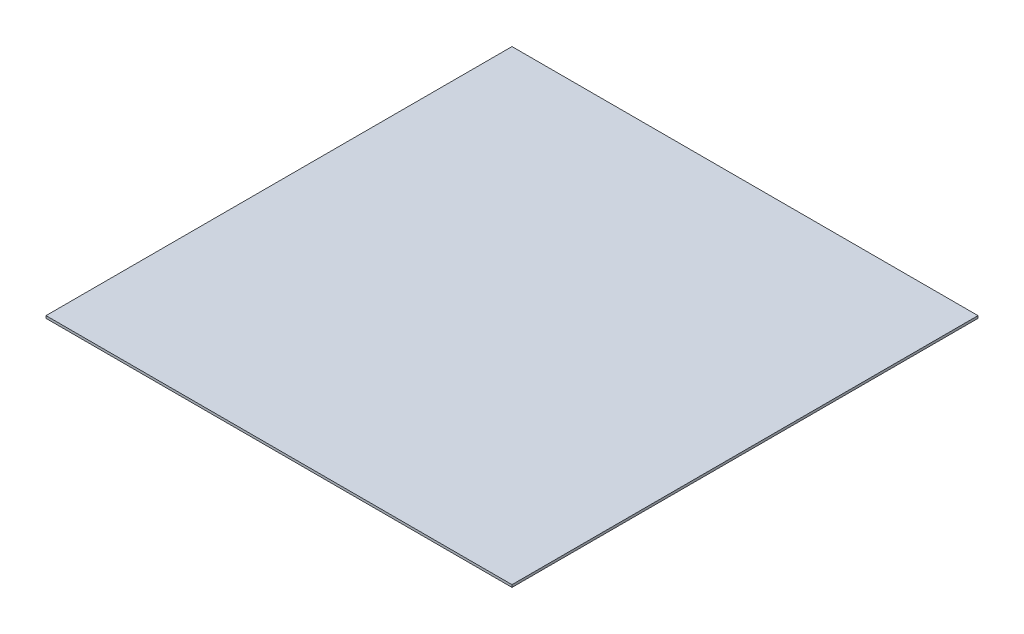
ISO-10303-21;
HEADER;
FILE_DESCRIPTION(('STEP AP214'),'2;1');
FILE_NAME('part.step','',(''),(''),'','','');
FILE_SCHEMA(('AUTOMOTIVE_DESIGN { 1 0 10303 214 1 1 1 1 }'));
ENDSEC;
DATA;
#1=APPLICATION_CONTEXT('core data for automotive mechanical design processes');
#2=APPLICATION_PROTOCOL_DEFINITION('international standard','automotive_design',2000,#1);
#3=PRODUCT_CONTEXT('',#1,'mechanical');
#4=PRODUCT('Part','Part','',(#3));
#5=PRODUCT_RELATED_PRODUCT_CATEGORY('part','',(#4));
#6=PRODUCT_DEFINITION_FORMATION('','',#4);
#7=PRODUCT_DEFINITION_CONTEXT('part definition',#1,'design');
#8=PRODUCT_DEFINITION('design','',#6,#7);
#9=PRODUCT_DEFINITION_SHAPE('','',#8);
#10=(LENGTH_UNIT() NAMED_UNIT(*) SI_UNIT(.MILLI.,.METRE.));
#11=(NAMED_UNIT(*) PLANE_ANGLE_UNIT() SI_UNIT($,.RADIAN.));
#12=(NAMED_UNIT(*) SI_UNIT($,.STERADIAN.) SOLID_ANGLE_UNIT());
#13=UNCERTAINTY_MEASURE_WITH_UNIT(LENGTH_MEASURE(1.E-05),#10,'distance_accuracy_value','');
#14=(GEOMETRIC_REPRESENTATION_CONTEXT(3) GLOBAL_UNCERTAINTY_ASSIGNED_CONTEXT((#13)) GLOBAL_UNIT_ASSIGNED_CONTEXT((#10,
#11,#12)) REPRESENTATION_CONTEXT('',''));
#15=CARTESIAN_POINT('',(0.,0.,0.));
#16=DIRECTION('',(0.,0.,1.));
#17=DIRECTION('',(1.,0.,0.));
#18=AXIS2_PLACEMENT_3D('',#15,#16,#17);
#19=CARTESIAN_POINT('',(609.6,6.35,-609.6));
#20=DIRECTION('',(-1.,0.,0.));
#21=DIRECTION('',(0.,0.,1.));
#22=AXIS2_PLACEMENT_3D('',#19,#20,#21);
#23=PLANE('',#22);
#24=DIRECTION('',(0.,0.,-1.));
#25=VECTOR('',#24,1.);
#26=CARTESIAN_POINT('',(609.6,0.,-609.6));
#27=LINE('',#26,#25);
#28=CARTESIAN_POINT('',(609.6,0.,609.6));
#29=VERTEX_POINT('',#28);
#30=CARTESIAN_POINT('',(609.6,0.,-609.6));
#31=VERTEX_POINT('',#30);
#32=EDGE_CURVE('E116',#29,#31,#27,.T.);
#33=ORIENTED_EDGE('',*,*,#32,.T.);
#34=DIRECTION('',(0.,-1.,0.));
#35=VECTOR('',#34,1.);
#36=CARTESIAN_POINT('',(609.6,6.35,-609.6));
#37=LINE('',#36,#35);
#38=CARTESIAN_POINT('',(609.6,6.35,-609.6));
#39=VERTEX_POINT('',#38);
#40=EDGE_CURVE('E11',#39,#31,#37,.T.);
#41=ORIENTED_EDGE('',*,*,#40,.F.);
#42=DIRECTION('',(0.,0.,-1.));
#43=VECTOR('',#42,1.);
#44=CARTESIAN_POINT('',(609.6,6.35,-609.6));
#45=LINE('',#44,#43);
#46=CARTESIAN_POINT('',(609.6,6.35,609.6));
#47=VERTEX_POINT('',#46);
#48=EDGE_CURVE('E99',#47,#39,#45,.T.);
#49=ORIENTED_EDGE('',*,*,#48,.F.);
#50=DIRECTION('',(0.,-1.,0.));
#51=VECTOR('',#50,1.);
#52=CARTESIAN_POINT('',(609.6,6.35,609.6));
#53=LINE('',#52,#51);
#54=EDGE_CURVE('E112',#47,#29,#53,.T.);
#55=ORIENTED_EDGE('',*,*,#54,.T.);
#56=EDGE_LOOP('',(#33,#41,#49,#55));
#57=FACE_BOUND('',#56,.T.);
#58=ADVANCED_FACE('F43',(#57),#23,.F.);
#59=CARTESIAN_POINT('',(-609.6,6.35,-609.6));
#60=DIRECTION('',(0.,0.,1.));
#61=DIRECTION('',(1.,0.,0.));
#62=AXIS2_PLACEMENT_3D('',#59,#60,#61);
#63=PLANE('',#62);
#64=DIRECTION('',(-1.,0.,0.));
#65=VECTOR('',#64,1.);
#66=CARTESIAN_POINT('',(-609.6,0.,-609.6));
#67=LINE('',#66,#65);
#68=CARTESIAN_POINT('',(-609.6,0.,-609.6));
#69=VERTEX_POINT('',#68);
#70=EDGE_CURVE('E104',#31,#69,#67,.T.);
#71=ORIENTED_EDGE('',*,*,#70,.T.);
#72=DIRECTION('',(0.,-1.,0.));
#73=VECTOR('',#72,1.);
#74=CARTESIAN_POINT('',(-609.6,6.35,-609.6));
#75=LINE('',#74,#73);
#76=CARTESIAN_POINT('',(-609.6,6.35,-609.6));
#77=VERTEX_POINT('',#76);
#78=EDGE_CURVE('E52',#77,#69,#75,.T.);
#79=ORIENTED_EDGE('',*,*,#78,.F.);
#80=DIRECTION('',(-1.,0.,0.));
#81=VECTOR('',#80,1.);
#82=CARTESIAN_POINT('',(-609.6,6.35,-609.6));
#83=LINE('',#82,#81);
#84=EDGE_CURVE('E94',#39,#77,#83,.T.);
#85=ORIENTED_EDGE('',*,*,#84,.F.);
#86=ORIENTED_EDGE('',*,*,#40,.T.);
#87=EDGE_LOOP('',(#71,#79,#85,#86));
#88=FACE_BOUND('',#87,.T.);
#89=ADVANCED_FACE('F103',(#88),#63,.F.);
#90=CARTESIAN_POINT('',(-609.6,6.35,-609.6));
#91=DIRECTION('',(1.,0.,0.));
#92=DIRECTION('',(0.,0.,-1.));
#93=AXIS2_PLACEMENT_3D('',#90,#91,#92);
#94=PLANE('',#93);
#95=DIRECTION('',(0.,0.,1.));
#96=VECTOR('',#95,1.);
#97=CARTESIAN_POINT('',(-609.6,0.,-609.6));
#98=LINE('',#97,#96);
#99=CARTESIAN_POINT('',(-609.6,0.,609.6));
#100=VERTEX_POINT('',#99);
#101=EDGE_CURVE('E80',#69,#100,#98,.T.);
#102=ORIENTED_EDGE('',*,*,#101,.T.);
#103=DIRECTION('',(0.,-1.,0.));
#104=VECTOR('',#103,1.);
#105=CARTESIAN_POINT('',(-609.6,6.35,609.6));
#106=LINE('',#105,#104);
#107=CARTESIAN_POINT('',(-609.6,6.35,609.6));
#108=VERTEX_POINT('',#107);
#109=EDGE_CURVE('E105',#108,#100,#106,.T.);
#110=ORIENTED_EDGE('',*,*,#109,.F.);
#111=DIRECTION('',(0.,0.,1.));
#112=VECTOR('',#111,1.);
#113=CARTESIAN_POINT('',(-609.6,6.35,-609.6));
#114=LINE('',#113,#112);
#115=EDGE_CURVE('E97',#77,#108,#114,.T.);
#116=ORIENTED_EDGE('',*,*,#115,.F.);
#117=ORIENTED_EDGE('',*,*,#78,.T.);
#118=EDGE_LOOP('',(#102,#110,#116,#117));
#119=FACE_BOUND('',#118,.T.);
#120=ADVANCED_FACE('F106',(#119),#94,.F.);
#121=CARTESIAN_POINT('',(-609.6,6.35,609.6));
#122=DIRECTION('',(0.,0.,-1.));
#123=DIRECTION('',(-1.,0.,0.));
#124=AXIS2_PLACEMENT_3D('',#121,#122,#123);
#125=PLANE('',#124);
#126=DIRECTION('',(1.,0.,0.));
#127=VECTOR('',#126,1.);
#128=CARTESIAN_POINT('',(-609.6,0.,609.6));
#129=LINE('',#128,#127);
#130=EDGE_CURVE('E87',#100,#29,#129,.T.);
#131=ORIENTED_EDGE('',*,*,#130,.T.);
#132=ORIENTED_EDGE('',*,*,#54,.F.);
#133=DIRECTION('',(1.,0.,0.));
#134=VECTOR('',#133,1.);
#135=CARTESIAN_POINT('',(-609.6,6.35,609.6));
#136=LINE('',#135,#134);
#137=EDGE_CURVE('E62',#108,#47,#136,.T.);
#138=ORIENTED_EDGE('',*,*,#137,.F.);
#139=ORIENTED_EDGE('',*,*,#109,.T.);
#140=EDGE_LOOP('',(#131,#132,#138,#139));
#141=FACE_BOUND('',#140,.T.);
#142=ADVANCED_FACE('F126',(#141),#125,.F.);
#143=CARTESIAN_POINT('',(0.,6.35,0.));
#144=DIRECTION('',(0.,1.,0.));
#145=DIRECTION('',(0.,0.,1.));
#146=AXIS2_PLACEMENT_3D('',#143,#144,#145);
#147=PLANE('',#146);
#148=ORIENTED_EDGE('',*,*,#48,.T.);
#149=ORIENTED_EDGE('',*,*,#84,.T.);
#150=ORIENTED_EDGE('',*,*,#115,.T.);
#151=ORIENTED_EDGE('',*,*,#137,.T.);
#152=EDGE_LOOP('',(#148,#149,#150,#151));
#153=FACE_BOUND('',#152,.T.);
#154=ADVANCED_FACE('F95',(#153),#147,.T.);
#155=CARTESIAN_POINT('',(0.,0.,0.));
#156=DIRECTION('',(0.,1.,0.));
#157=DIRECTION('',(0.,0.,1.));
#158=AXIS2_PLACEMENT_3D('',#155,#156,#157);
#159=PLANE('',#158);
#160=ORIENTED_EDGE('',*,*,#32,.F.);
#161=ORIENTED_EDGE('',*,*,#130,.F.);
#162=ORIENTED_EDGE('',*,*,#101,.F.);
#163=ORIENTED_EDGE('',*,*,#70,.F.);
#164=EDGE_LOOP('',(#160,#161,#162,#163));
#165=FACE_BOUND('',#164,.T.);
#166=ADVANCED_FACE('F129',(#165),#159,.F.);
#167=CLOSED_SHELL('',(#58,#89,#120,#142,#154,#166));
#168=MANIFOLD_SOLID_BREP('B2',#167);
#169=ADVANCED_BREP_SHAPE_REPRESENTATION('',(#18,#168),#14);
#170=SHAPE_DEFINITION_REPRESENTATION(#9,#169);
ENDSEC;
END-ISO-10303-21;
